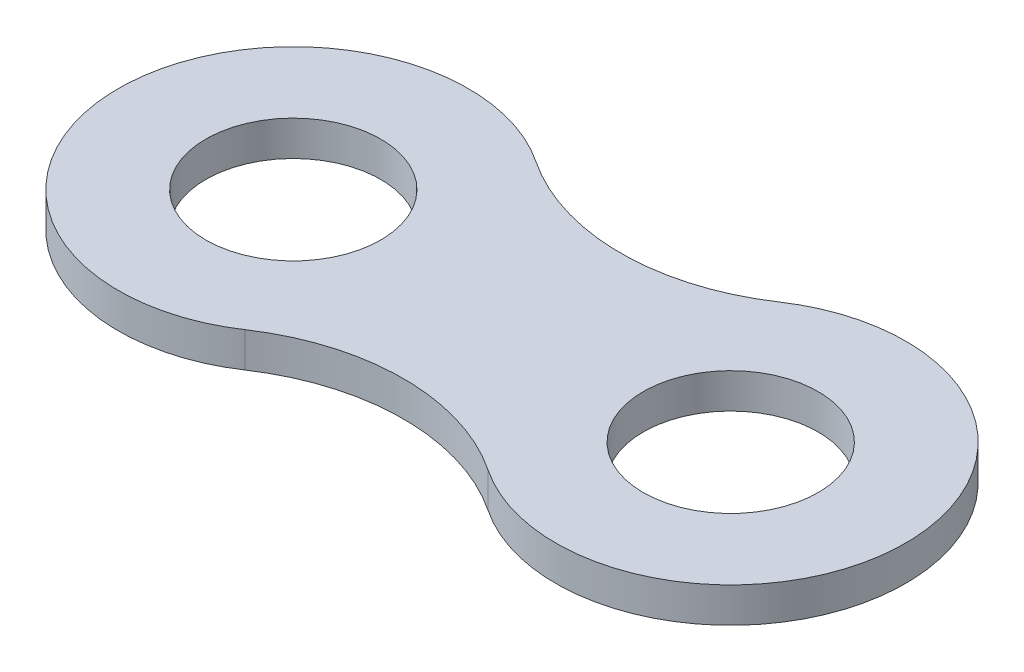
ISO-10303-21;
HEADER;
FILE_DESCRIPTION(('STEP AP214'),'2;1');
FILE_NAME('part.step','',(''),(''),'','','');
FILE_SCHEMA(('AUTOMOTIVE_DESIGN { 1 0 10303 214 1 1 1 1 }'));
ENDSEC;
DATA;
#1=APPLICATION_CONTEXT('core data for automotive mechanical design processes');
#2=APPLICATION_PROTOCOL_DEFINITION('international standard','automotive_design',2000,#1);
#3=PRODUCT_CONTEXT('',#1,'mechanical');
#4=PRODUCT('Part','Part','',(#3));
#5=PRODUCT_RELATED_PRODUCT_CATEGORY('part','',(#4));
#6=PRODUCT_DEFINITION_FORMATION('','',#4);
#7=PRODUCT_DEFINITION_CONTEXT('part definition',#1,'design');
#8=PRODUCT_DEFINITION('design','',#6,#7);
#9=PRODUCT_DEFINITION_SHAPE('','',#8);
#10=(LENGTH_UNIT() NAMED_UNIT(*) SI_UNIT(.MILLI.,.METRE.));
#11=(NAMED_UNIT(*) PLANE_ANGLE_UNIT() SI_UNIT($,.RADIAN.));
#12=(NAMED_UNIT(*) SI_UNIT($,.STERADIAN.) SOLID_ANGLE_UNIT());
#13=UNCERTAINTY_MEASURE_WITH_UNIT(LENGTH_MEASURE(1.E-05),#10,'distance_accuracy_value','');
#14=(GEOMETRIC_REPRESENTATION_CONTEXT(3) GLOBAL_UNCERTAINTY_ASSIGNED_CONTEXT((#13)) GLOBAL_UNIT_ASSIGNED_CONTEXT((#10,
#11,#12)) REPRESENTATION_CONTEXT('',''));
#15=CARTESIAN_POINT('',(0.,0.,0.));
#16=DIRECTION('',(0.,0.,1.));
#17=DIRECTION('',(1.,0.,0.));
#18=AXIS2_PLACEMENT_3D('',#15,#16,#17);
#19=CARTESIAN_POINT('',(6.35,1.016,-9.50380976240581));
#20=DIRECTION('',(0.,-1.,0.));
#21=DIRECTION('',(0.,0.,-1.));
#22=AXIS2_PLACEMENT_3D('',#19,#20,#21);
#23=CYLINDRICAL_SURFACE('',#22,6.35);
#24=CARTESIAN_POINT('',(6.35,0.,-9.50380976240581));
#25=DIRECTION('',(0.,-1.,0.));
#26=DIRECTION('',(0.,0.,1.));
#27=AXIS2_PLACEMENT_3D('',#24,#25,#26);
#28=CIRCLE('',#27,6.35);
#29=CARTESIAN_POINT('',(9.87777777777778,0.,-4.22391544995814));
#30=VERTEX_POINT('',#29);
#31=CARTESIAN_POINT('',(2.82222222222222,0.,-4.22391544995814));
#32=VERTEX_POINT('',#31);
#33=EDGE_CURVE('E87',#30,#32,#28,.T.);
#34=ORIENTED_EDGE('',*,*,#33,.T.);
#35=DIRECTION('',(0.,-1.,0.));
#36=VECTOR('',#35,1.);
#37=CARTESIAN_POINT('',(2.82222222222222,1.016,-4.22391544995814));
#38=LINE('',#37,#36);
#39=CARTESIAN_POINT('',(2.82222222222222,1.016,-4.22391544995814));
#40=VERTEX_POINT('',#39);
#41=EDGE_CURVE('E13',#40,#32,#38,.T.);
#42=ORIENTED_EDGE('',*,*,#41,.F.);
#43=CARTESIAN_POINT('',(6.35,1.016,-9.50380976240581));
#44=DIRECTION('',(0.,-1.,0.));
#45=DIRECTION('',(0.,0.,1.));
#46=AXIS2_PLACEMENT_3D('',#43,#44,#45);
#47=CIRCLE('',#46,6.35);
#48=CARTESIAN_POINT('',(9.87777777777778,1.016,-4.22391544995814));
#49=VERTEX_POINT('',#48);
#50=EDGE_CURVE('E110',#49,#40,#47,.T.);
#51=ORIENTED_EDGE('',*,*,#50,.F.);
#52=DIRECTION('',(0.,-1.,0.));
#53=VECTOR('',#52,1.);
#54=CARTESIAN_POINT('',(9.87777777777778,1.016,-4.22391544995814));
#55=LINE('',#54,#53);
#56=EDGE_CURVE('E99',#49,#30,#55,.T.);
#57=ORIENTED_EDGE('',*,*,#56,.T.);
#58=EDGE_LOOP('',(#34,#42,#51,#57));
#59=FACE_BOUND('',#58,.T.);
#60=ADVANCED_FACE('F43',(#59),#23,.F.);
#61=CARTESIAN_POINT('',(0.,1.016,0.));
#62=DIRECTION('',(0.,-1.,0.));
#63=DIRECTION('',(0.,0.,-1.));
#64=AXIS2_PLACEMENT_3D('',#61,#62,#63);
#65=CYLINDRICAL_SURFACE('',#64,5.08);
#66=CARTESIAN_POINT('',(0.,0.,0.));
#67=DIRECTION('',(0.,1.,0.));
#68=DIRECTION('',(0.,0.,1.));
#69=AXIS2_PLACEMENT_3D('',#66,#67,#68);
#70=CIRCLE('',#69,5.08);
#71=CARTESIAN_POINT('',(2.82222222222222,0.,4.22391544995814));
#72=VERTEX_POINT('',#71);
#73=EDGE_CURVE('E83',#32,#72,#70,.T.);
#74=ORIENTED_EDGE('',*,*,#73,.T.);
#75=DIRECTION('',(0.,-1.,0.));
#76=VECTOR('',#75,1.);
#77=CARTESIAN_POINT('',(2.82222222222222,1.016,4.22391544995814));
#78=LINE('',#77,#76);
#79=CARTESIAN_POINT('',(2.82222222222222,1.016,4.22391544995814));
#80=VERTEX_POINT('',#79);
#81=EDGE_CURVE('E50',#80,#72,#78,.T.);
#82=ORIENTED_EDGE('',*,*,#81,.F.);
#83=CARTESIAN_POINT('',(0.,1.016,0.));
#84=DIRECTION('',(0.,1.,0.));
#85=DIRECTION('',(0.,0.,1.));
#86=AXIS2_PLACEMENT_3D('',#83,#84,#85);
#87=CIRCLE('',#86,5.08);
#88=EDGE_CURVE('E95',#40,#80,#87,.T.);
#89=ORIENTED_EDGE('',*,*,#88,.F.);
#90=ORIENTED_EDGE('',*,*,#41,.T.);
#91=EDGE_LOOP('',(#74,#82,#89,#90));
#92=FACE_BOUND('',#91,.T.);
#93=ADVANCED_FACE('F94',(#92),#65,.T.);
#94=CARTESIAN_POINT('',(6.35,1.016,9.50380976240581));
#95=DIRECTION('',(0.,-1.,0.));
#96=DIRECTION('',(0.,0.,-1.));
#97=AXIS2_PLACEMENT_3D('',#94,#95,#96);
#98=CYLINDRICAL_SURFACE('',#97,6.35);
#99=CARTESIAN_POINT('',(6.35,0.,9.50380976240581));
#100=DIRECTION('',(0.,-1.,0.));
#101=DIRECTION('',(0.,0.,1.));
#102=AXIS2_PLACEMENT_3D('',#99,#100,#101);
#103=CIRCLE('',#102,6.35);
#104=CARTESIAN_POINT('',(9.87777777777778,0.,4.22391544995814));
#105=VERTEX_POINT('',#104);
#106=EDGE_CURVE('E88',#72,#105,#103,.T.);
#107=ORIENTED_EDGE('',*,*,#106,.T.);
#108=DIRECTION('',(0.,-1.,0.));
#109=VECTOR('',#108,1.);
#110=CARTESIAN_POINT('',(9.87777777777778,1.016,4.22391544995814));
#111=LINE('',#110,#109);
#112=CARTESIAN_POINT('',(9.87777777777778,1.016,4.22391544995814));
#113=VERTEX_POINT('',#112);
#114=EDGE_CURVE('E116',#113,#105,#111,.T.);
#115=ORIENTED_EDGE('',*,*,#114,.F.);
#116=CARTESIAN_POINT('',(6.35,1.016,9.50380976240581));
#117=DIRECTION('',(0.,-1.,0.));
#118=DIRECTION('',(0.,0.,1.));
#119=AXIS2_PLACEMENT_3D('',#116,#117,#118);
#120=CIRCLE('',#119,6.35);
#121=EDGE_CURVE('E62',#80,#113,#120,.T.);
#122=ORIENTED_EDGE('',*,*,#121,.F.);
#123=ORIENTED_EDGE('',*,*,#81,.T.);
#124=EDGE_LOOP('',(#107,#115,#122,#123));
#125=FACE_BOUND('',#124,.T.);
#126=ADVANCED_FACE('F119',(#125),#98,.F.);
#127=CARTESIAN_POINT('',(12.7,1.016,0.));
#128=DIRECTION('',(0.,-1.,0.));
#129=DIRECTION('',(0.,0.,-1.));
#130=AXIS2_PLACEMENT_3D('',#127,#128,#129);
#131=CYLINDRICAL_SURFACE('',#130,5.08);
#132=CARTESIAN_POINT('',(12.7,0.,0.));
#133=DIRECTION('',(0.,1.,0.));
#134=DIRECTION('',(0.,0.,-1.));
#135=AXIS2_PLACEMENT_3D('',#132,#133,#134);
#136=CIRCLE('',#135,5.08);
#137=EDGE_CURVE('E108',#105,#30,#136,.T.);
#138=ORIENTED_EDGE('',*,*,#137,.T.);
#139=ORIENTED_EDGE('',*,*,#56,.F.);
#140=CARTESIAN_POINT('',(12.7,1.016,0.));
#141=DIRECTION('',(0.,1.,0.));
#142=DIRECTION('',(0.,0.,-1.));
#143=AXIS2_PLACEMENT_3D('',#140,#141,#142);
#144=CIRCLE('',#143,5.08);
#145=EDGE_CURVE('E57',#113,#49,#144,.T.);
#146=ORIENTED_EDGE('',*,*,#145,.F.);
#147=ORIENTED_EDGE('',*,*,#114,.T.);
#148=EDGE_LOOP('',(#138,#139,#146,#147));
#149=FACE_BOUND('',#148,.T.);
#150=ADVANCED_FACE('F121',(#149),#131,.T.);
#151=CARTESIAN_POINT('',(9.525,1.016,-4.7519048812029));
#152=DIRECTION('',(0.,1.,0.));
#153=DIRECTION('',(0.,0.,1.));
#154=AXIS2_PLACEMENT_3D('',#151,#152,#153);
#155=PLANE('',#154);
#156=CARTESIAN_POINT('',(12.7,1.016,0.));
#157=DIRECTION('',(0.,1.,0.));
#158=DIRECTION('',(0.,0.,1.));
#159=AXIS2_PLACEMENT_3D('',#156,#157,#158);
#160=CIRCLE('',#159,2.54);
#161=CARTESIAN_POINT('',(12.7,1.016,2.54));
#162=VERTEX_POINT('',#161);
#163=EDGE_CURVE('E162',#162,#162,#160,.T.);
#164=ORIENTED_EDGE('',*,*,#163,.F.);
#165=EDGE_LOOP('',(#164));
#166=FACE_BOUND('',#165,.T.);
#167=CARTESIAN_POINT('',(0.,1.016,0.));
#168=DIRECTION('',(0.,1.,0.));
#169=DIRECTION('',(0.,0.,1.));
#170=AXIS2_PLACEMENT_3D('',#167,#168,#169);
#171=CIRCLE('',#170,2.54);
#172=CARTESIAN_POINT('',(0.,1.016,2.54));
#173=VERTEX_POINT('',#172);
#174=EDGE_CURVE('E103',#173,#173,#171,.T.);
#175=ORIENTED_EDGE('',*,*,#174,.F.);
#176=EDGE_LOOP('',(#175));
#177=FACE_BOUND('',#176,.T.);
#178=ORIENTED_EDGE('',*,*,#50,.T.);
#179=ORIENTED_EDGE('',*,*,#88,.T.);
#180=ORIENTED_EDGE('',*,*,#121,.T.);
#181=ORIENTED_EDGE('',*,*,#145,.T.);
#182=EDGE_LOOP('',(#178,#179,#180,#181));
#183=FACE_BOUND('',#182,.T.);
#184=ADVANCED_FACE('F122',(#166,#177,#183),#155,.T.);
#185=CARTESIAN_POINT('',(9.525,0.,-4.7519048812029));
#186=DIRECTION('',(0.,1.,0.));
#187=DIRECTION('',(0.,0.,1.));
#188=AXIS2_PLACEMENT_3D('',#185,#186,#187);
#189=PLANE('',#188);
#190=CARTESIAN_POINT('',(12.7,0.,0.));
#191=DIRECTION('',(0.,1.,0.));
#192=DIRECTION('',(0.,0.,1.));
#193=AXIS2_PLACEMENT_3D('',#190,#191,#192);
#194=CIRCLE('',#193,2.54);
#195=CARTESIAN_POINT('',(12.7,0.,2.54));
#196=VERTEX_POINT('',#195);
#197=EDGE_CURVE('E160',#196,#196,#194,.T.);
#198=ORIENTED_EDGE('',*,*,#197,.T.);
#199=EDGE_LOOP('',(#198));
#200=FACE_BOUND('',#199,.T.);
#201=CARTESIAN_POINT('',(0.,0.,0.));
#202=DIRECTION('',(0.,1.,0.));
#203=DIRECTION('',(0.,0.,1.));
#204=AXIS2_PLACEMENT_3D('',#201,#202,#203);
#205=CIRCLE('',#204,2.54);
#206=CARTESIAN_POINT('',(0.,0.,2.54));
#207=VERTEX_POINT('',#206);
#208=EDGE_CURVE('E100',#207,#207,#205,.T.);
#209=ORIENTED_EDGE('',*,*,#208,.T.);
#210=EDGE_LOOP('',(#209));
#211=FACE_BOUND('',#210,.T.);
#212=ORIENTED_EDGE('',*,*,#33,.F.);
#213=ORIENTED_EDGE('',*,*,#137,.F.);
#214=ORIENTED_EDGE('',*,*,#106,.F.);
#215=ORIENTED_EDGE('',*,*,#73,.F.);
#216=EDGE_LOOP('',(#212,#213,#214,#215));
#217=FACE_BOUND('',#216,.T.);
#218=ADVANCED_FACE('F84',(#200,#211,#217),#189,.F.);
#219=CARTESIAN_POINT('',(0.,0.,0.));
#220=DIRECTION('',(0.,1.,0.));
#221=DIRECTION('',(0.,0.,1.));
#222=AXIS2_PLACEMENT_3D('',#219,#220,#221);
#223=CYLINDRICAL_SURFACE('',#222,2.54);
#224=ORIENTED_EDGE('',*,*,#208,.F.);
#225=EDGE_LOOP('',(#224));
#226=FACE_BOUND('',#225,.T.);
#227=ORIENTED_EDGE('',*,*,#174,.T.);
#228=EDGE_LOOP('',(#227));
#229=FACE_BOUND('',#228,.T.);
#230=ADVANCED_FACE('F130',(#226,#229),#223,.F.);
#231=CARTESIAN_POINT('',(12.7,0.,0.));
#232=DIRECTION('',(0.,1.,0.));
#233=DIRECTION('',(0.,0.,1.));
#234=AXIS2_PLACEMENT_3D('',#231,#232,#233);
#235=CYLINDRICAL_SURFACE('',#234,2.54);
#236=ORIENTED_EDGE('',*,*,#197,.F.);
#237=EDGE_LOOP('',(#236));
#238=FACE_BOUND('',#237,.T.);
#239=ORIENTED_EDGE('',*,*,#163,.T.);
#240=EDGE_LOOP('',(#239));
#241=FACE_BOUND('',#240,.T.);
#242=ADVANCED_FACE('F151',(#238,#241),#235,.F.);
#243=CLOSED_SHELL('',(#60,#93,#126,#150,#184,#218,#230,#242));
#244=MANIFOLD_SOLID_BREP('B2',#243);
#245=ADVANCED_BREP_SHAPE_REPRESENTATION('',(#18,#244),#14);
#246=SHAPE_DEFINITION_REPRESENTATION(#9,#245);
ENDSEC;
END-ISO-10303-21;
